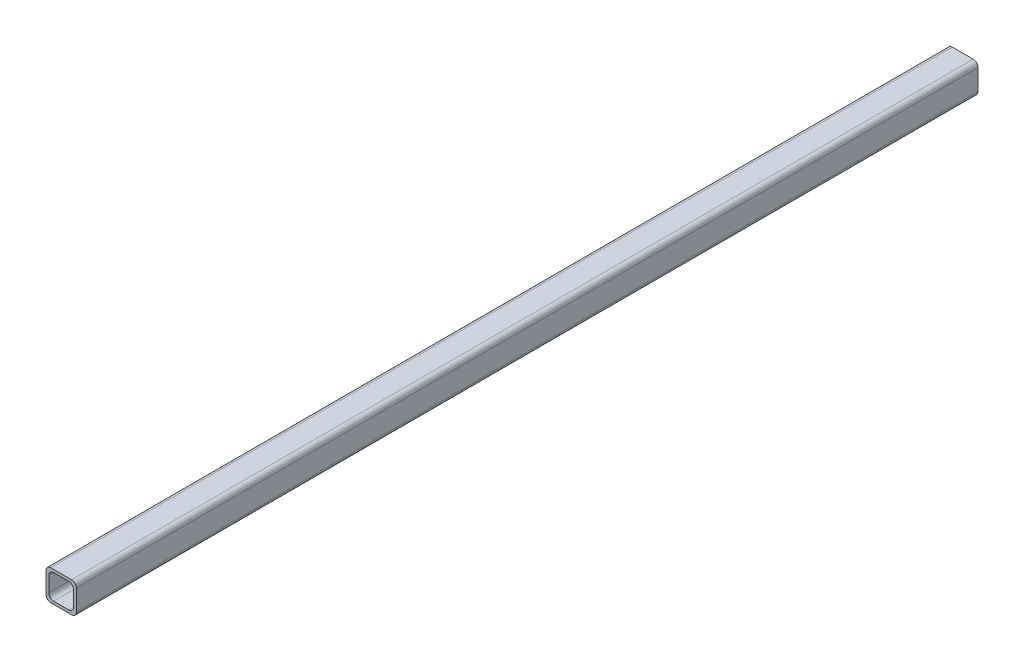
ISO-10303-21;
HEADER;
FILE_DESCRIPTION(('STEP AP214'),'2;1');
FILE_NAME('part.step','',(''),(''),'','','');
FILE_SCHEMA(('AUTOMOTIVE_DESIGN { 1 0 10303 214 1 1 1 1 }'));
ENDSEC;
DATA;
#1=APPLICATION_CONTEXT('core data for automotive mechanical design processes');
#2=APPLICATION_PROTOCOL_DEFINITION('international standard','automotive_design',2000,#1);
#3=PRODUCT_CONTEXT('',#1,'mechanical');
#4=PRODUCT('Part','Part','',(#3));
#5=PRODUCT_RELATED_PRODUCT_CATEGORY('part','',(#4));
#6=PRODUCT_DEFINITION_FORMATION('','',#4);
#7=PRODUCT_DEFINITION_CONTEXT('part definition',#1,'design');
#8=PRODUCT_DEFINITION('design','',#6,#7);
#9=PRODUCT_DEFINITION_SHAPE('','',#8);
#10=(LENGTH_UNIT() NAMED_UNIT(*) SI_UNIT(.MILLI.,.METRE.));
#11=(NAMED_UNIT(*) PLANE_ANGLE_UNIT() SI_UNIT($,.RADIAN.));
#12=(NAMED_UNIT(*) SI_UNIT($,.STERADIAN.) SOLID_ANGLE_UNIT());
#13=UNCERTAINTY_MEASURE_WITH_UNIT(LENGTH_MEASURE(1.E-05),#10,'distance_accuracy_value','');
#14=(GEOMETRIC_REPRESENTATION_CONTEXT(3) GLOBAL_UNCERTAINTY_ASSIGNED_CONTEXT((#13)) GLOBAL_UNIT_ASSIGNED_CONTEXT((#10,
#11,#12)) REPRESENTATION_CONTEXT('',''));
#15=CARTESIAN_POINT('',(0.,0.,0.));
#16=DIRECTION('',(0.,0.,1.));
#17=DIRECTION('',(1.,0.,0.));
#18=AXIS2_PLACEMENT_3D('',#15,#16,#17);
#19=CARTESIAN_POINT('',(-5.49999999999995,5.50000000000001,475.));
#20=DIRECTION('',(0.,0.,1.));
#21=DIRECTION('',(1.,0.,0.));
#22=AXIS2_PLACEMENT_3D('',#19,#20,#21);
#23=PLANE('',#22);
#24=CARTESIAN_POINT('',(-5.49999999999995,5.50000000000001,475.));
#25=DIRECTION('',(0.,0.,1.));
#26=DIRECTION('',(1.,0.,0.));
#27=AXIS2_PLACEMENT_3D('',#24,#25,#26);
#28=CIRCLE('',#27,2.5);
#29=CARTESIAN_POINT('',(-5.49999999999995,8.00000000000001,475.));
#30=VERTEX_POINT('',#29);
#31=CARTESIAN_POINT('',(-7.99999999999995,5.50000000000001,475.));
#32=VERTEX_POINT('',#31);
#33=EDGE_CURVE('E232',#30,#32,#28,.T.);
#34=ORIENTED_EDGE('',*,*,#33,.T.);
#35=DIRECTION('',(0.,-1.,0.));
#36=VECTOR('',#35,1.);
#37=CARTESIAN_POINT('',(-7.99999999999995,5.50000000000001,475.));
#38=LINE('',#37,#36);
#39=CARTESIAN_POINT('',(-7.99999999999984,-5.50000000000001,475.));
#40=VERTEX_POINT('',#39);
#41=EDGE_CURVE('E235',#32,#40,#38,.T.);
#42=ORIENTED_EDGE('',*,*,#41,.T.);
#43=CARTESIAN_POINT('',(-5.49999999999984,-5.50000000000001,475.));
#44=DIRECTION('',(0.,0.,-1.));
#45=DIRECTION('',(-1.,0.,0.));
#46=AXIS2_PLACEMENT_3D('',#43,#44,#45);
#47=CIRCLE('',#46,2.5);
#48=CARTESIAN_POINT('',(-5.49999999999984,-8.00000000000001,475.));
#49=VERTEX_POINT('',#48);
#50=EDGE_CURVE('E238',#49,#40,#47,.T.);
#51=ORIENTED_EDGE('',*,*,#50,.F.);
#52=DIRECTION('',(-1.,0.,0.));
#53=VECTOR('',#52,1.);
#54=CARTESIAN_POINT('',(5.50000000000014,-8.00000000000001,475.));
#55=LINE('',#54,#53);
#56=CARTESIAN_POINT('',(5.50000000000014,-8.00000000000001,475.));
#57=VERTEX_POINT('',#56);
#58=EDGE_CURVE('E241',#57,#49,#55,.T.);
#59=ORIENTED_EDGE('',*,*,#58,.F.);
#60=CARTESIAN_POINT('',(5.50000000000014,-5.50000000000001,475.));
#61=DIRECTION('',(0.,0.,-1.));
#62=DIRECTION('',(-1.,0.,0.));
#63=AXIS2_PLACEMENT_3D('',#60,#61,#62);
#64=CIRCLE('',#63,2.5);
#65=CARTESIAN_POINT('',(8.00000000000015,-5.50000000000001,475.));
#66=VERTEX_POINT('',#65);
#67=EDGE_CURVE('E244',#66,#57,#64,.T.);
#68=ORIENTED_EDGE('',*,*,#67,.F.);
#69=DIRECTION('',(0.,1.,0.));
#70=VECTOR('',#69,1.);
#71=CARTESIAN_POINT('',(8.00000000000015,-5.50000000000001,475.));
#72=LINE('',#71,#70);
#73=CARTESIAN_POINT('',(8.00000000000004,5.50000000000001,475.));
#74=VERTEX_POINT('',#73);
#75=EDGE_CURVE('E247',#66,#74,#72,.T.);
#76=ORIENTED_EDGE('',*,*,#75,.T.);
#77=CARTESIAN_POINT('',(5.50000000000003,5.50000000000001,475.));
#78=DIRECTION('',(0.,0.,1.));
#79=DIRECTION('',(1.,0.,0.));
#80=AXIS2_PLACEMENT_3D('',#77,#78,#79);
#81=CIRCLE('',#80,2.5);
#82=CARTESIAN_POINT('',(5.50000000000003,8.00000000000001,475.));
#83=VERTEX_POINT('',#82);
#84=EDGE_CURVE('E250',#74,#83,#81,.T.);
#85=ORIENTED_EDGE('',*,*,#84,.T.);
#86=DIRECTION('',(1.,0.,0.));
#87=VECTOR('',#86,1.);
#88=CARTESIAN_POINT('',(-5.49999999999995,8.00000000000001,475.));
#89=LINE('',#88,#87);
#90=EDGE_CURVE('E253',#30,#83,#89,.T.);
#91=ORIENTED_EDGE('',*,*,#90,.F.);
#92=EDGE_LOOP('',(#34,#42,#51,#59,#68,#76,#85,#91));
#93=FACE_BOUND('',#92,.T.);
#94=DIRECTION('',(0.,-1.,0.));
#95=VECTOR('',#94,1.);
#96=CARTESIAN_POINT('',(-6.49999999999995,4.,475.));
#97=LINE('',#96,#95);
#98=CARTESIAN_POINT('',(-6.49999999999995,4.,475.));
#99=VERTEX_POINT('',#98);
#100=CARTESIAN_POINT('',(-6.49999999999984,-4.,475.));
#101=VERTEX_POINT('',#100);
#102=EDGE_CURVE('E178',#99,#101,#97,.T.);
#103=ORIENTED_EDGE('',*,*,#102,.F.);
#104=CARTESIAN_POINT('',(-3.99999999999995,4.,475.));
#105=DIRECTION('',(0.,0.,1.));
#106=DIRECTION('',(1.,0.,0.));
#107=AXIS2_PLACEMENT_3D('',#104,#105,#106);
#108=CIRCLE('',#107,2.5);
#109=CARTESIAN_POINT('',(-3.99999999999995,6.50000000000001,475.));
#110=VERTEX_POINT('',#109);
#111=EDGE_CURVE('E142',#110,#99,#108,.T.);
#112=ORIENTED_EDGE('',*,*,#111,.F.);
#113=DIRECTION('',(1.,0.,0.));
#114=VECTOR('',#113,1.);
#115=CARTESIAN_POINT('',(-3.99999999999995,6.50000000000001,475.));
#116=LINE('',#115,#114);
#117=CARTESIAN_POINT('',(4.00000000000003,6.50000000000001,475.));
#118=VERTEX_POINT('',#117);
#119=EDGE_CURVE('E193',#110,#118,#116,.T.);
#120=ORIENTED_EDGE('',*,*,#119,.T.);
#121=CARTESIAN_POINT('',(4.00000000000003,4.,475.));
#122=DIRECTION('',(0.,0.,1.));
#123=DIRECTION('',(1.,0.,0.));
#124=AXIS2_PLACEMENT_3D('',#121,#122,#123);
#125=CIRCLE('',#124,2.5);
#126=CARTESIAN_POINT('',(6.50000000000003,4.,475.));
#127=VERTEX_POINT('',#126);
#128=EDGE_CURVE('E43',#127,#118,#125,.T.);
#129=ORIENTED_EDGE('',*,*,#128,.F.);
#130=DIRECTION('',(0.,1.,0.));
#131=VECTOR('',#130,1.);
#132=CARTESIAN_POINT('',(6.50000000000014,-4.,475.));
#133=LINE('',#132,#131);
#134=CARTESIAN_POINT('',(6.50000000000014,-4.,475.));
#135=VERTEX_POINT('',#134);
#136=EDGE_CURVE('E189',#135,#127,#133,.T.);
#137=ORIENTED_EDGE('',*,*,#136,.F.);
#138=CARTESIAN_POINT('',(4.00000000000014,-4.,475.));
#139=DIRECTION('',(0.,0.,-1.));
#140=DIRECTION('',(-1.,0.,0.));
#141=AXIS2_PLACEMENT_3D('',#138,#139,#140);
#142=CIRCLE('',#141,2.5);
#143=CARTESIAN_POINT('',(4.00000000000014,-6.50000000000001,475.));
#144=VERTEX_POINT('',#143);
#145=EDGE_CURVE('E186',#135,#144,#142,.T.);
#146=ORIENTED_EDGE('',*,*,#145,.T.);
#147=DIRECTION('',(-1.,0.,0.));
#148=VECTOR('',#147,1.);
#149=CARTESIAN_POINT('',(4.00000000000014,-6.50000000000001,475.));
#150=LINE('',#149,#148);
#151=CARTESIAN_POINT('',(-3.99999999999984,-6.50000000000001,475.));
#152=VERTEX_POINT('',#151);
#153=EDGE_CURVE('E183',#144,#152,#150,.T.);
#154=ORIENTED_EDGE('',*,*,#153,.T.);
#155=CARTESIAN_POINT('',(-3.99999999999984,-4.,475.));
#156=DIRECTION('',(0.,0.,1.));
#157=DIRECTION('',(1.,0.,0.));
#158=AXIS2_PLACEMENT_3D('',#155,#156,#157);
#159=CIRCLE('',#158,2.5);
#160=EDGE_CURVE('E180',#101,#152,#159,.T.);
#161=ORIENTED_EDGE('',*,*,#160,.F.);
#162=EDGE_LOOP('',(#103,#112,#120,#129,#137,#146,#154,#161));
#163=FACE_BOUND('',#162,.T.);
#164=ADVANCED_FACE('F28',(#93,#163),#23,.T.);
#165=CARTESIAN_POINT('',(-5.50000000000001,5.50000000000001,0.));
#166=DIRECTION('',(0.,0.,1.));
#167=DIRECTION('',(1.,0.,0.));
#168=AXIS2_PLACEMENT_3D('',#165,#166,#167);
#169=PLANE('',#168);
#170=CARTESIAN_POINT('',(-5.50000000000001,5.50000000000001,0.));
#171=DIRECTION('',(0.,0.,1.));
#172=DIRECTION('',(1.,0.,0.));
#173=AXIS2_PLACEMENT_3D('',#170,#171,#172);
#174=CIRCLE('',#173,2.5);
#175=CARTESIAN_POINT('',(-5.50000000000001,8.00000000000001,0.));
#176=VERTEX_POINT('',#175);
#177=CARTESIAN_POINT('',(-8.00000000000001,5.50000000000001,0.));
#178=VERTEX_POINT('',#177);
#179=EDGE_CURVE('E146',#176,#178,#174,.T.);
#180=ORIENTED_EDGE('',*,*,#179,.F.);
#181=DIRECTION('',(1.,0.,0.));
#182=VECTOR('',#181,1.);
#183=CARTESIAN_POINT('',(-5.50000000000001,8.00000000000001,0.));
#184=LINE('',#183,#182);
#185=CARTESIAN_POINT('',(5.50000000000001,8.00000000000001,0.));
#186=VERTEX_POINT('',#185);
#187=EDGE_CURVE('E229',#176,#186,#184,.T.);
#188=ORIENTED_EDGE('',*,*,#187,.T.);
#189=CARTESIAN_POINT('',(5.49999999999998,5.50000000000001,0.));
#190=DIRECTION('',(0.,0.,1.));
#191=DIRECTION('',(1.,0.,0.));
#192=AXIS2_PLACEMENT_3D('',#189,#190,#191);
#193=CIRCLE('',#192,2.5);
#194=CARTESIAN_POINT('',(7.99999999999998,5.50000000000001,0.));
#195=VERTEX_POINT('',#194);
#196=EDGE_CURVE('E226',#195,#186,#193,.T.);
#197=ORIENTED_EDGE('',*,*,#196,.F.);
#198=DIRECTION('',(0.,1.,0.));
#199=VECTOR('',#198,1.);
#200=CARTESIAN_POINT('',(7.99999999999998,-5.50000000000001,0.));
#201=LINE('',#200,#199);
#202=CARTESIAN_POINT('',(7.99999999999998,-5.50000000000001,0.));
#203=VERTEX_POINT('',#202);
#204=EDGE_CURVE('E223',#203,#195,#201,.T.);
#205=ORIENTED_EDGE('',*,*,#204,.F.);
#206=CARTESIAN_POINT('',(5.49999999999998,-5.50000000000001,0.));
#207=DIRECTION('',(0.,0.,-1.));
#208=DIRECTION('',(-1.,0.,0.));
#209=AXIS2_PLACEMENT_3D('',#206,#207,#208);
#210=CIRCLE('',#209,2.5);
#211=CARTESIAN_POINT('',(5.49999999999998,-8.00000000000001,0.));
#212=VERTEX_POINT('',#211);
#213=EDGE_CURVE('E220',#203,#212,#210,.T.);
#214=ORIENTED_EDGE('',*,*,#213,.T.);
#215=DIRECTION('',(-1.,0.,0.));
#216=VECTOR('',#215,1.);
#217=CARTESIAN_POINT('',(5.49999999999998,-8.00000000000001,0.));
#218=LINE('',#217,#216);
#219=CARTESIAN_POINT('',(-5.50000000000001,-8.00000000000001,0.));
#220=VERTEX_POINT('',#219);
#221=EDGE_CURVE('E217',#212,#220,#218,.T.);
#222=ORIENTED_EDGE('',*,*,#221,.T.);
#223=CARTESIAN_POINT('',(-5.50000000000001,-5.50000000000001,0.));
#224=DIRECTION('',(0.,0.,-1.));
#225=DIRECTION('',(-1.,0.,0.));
#226=AXIS2_PLACEMENT_3D('',#223,#224,#225);
#227=CIRCLE('',#226,2.5);
#228=CARTESIAN_POINT('',(-8.00000000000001,-5.50000000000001,0.));
#229=VERTEX_POINT('',#228);
#230=EDGE_CURVE('E214',#220,#229,#227,.T.);
#231=ORIENTED_EDGE('',*,*,#230,.T.);
#232=DIRECTION('',(0.,-1.,0.));
#233=VECTOR('',#232,1.);
#234=CARTESIAN_POINT('',(-8.00000000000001,5.50000000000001,0.));
#235=LINE('',#234,#233);
#236=EDGE_CURVE('E211',#178,#229,#235,.T.);
#237=ORIENTED_EDGE('',*,*,#236,.F.);
#238=EDGE_LOOP('',(#180,#188,#197,#205,#214,#222,#231,#237));
#239=FACE_BOUND('',#238,.T.);
#240=CARTESIAN_POINT('',(-4.,4.,0.));
#241=DIRECTION('',(0.,0.,1.));
#242=DIRECTION('',(1.,0.,0.));
#243=AXIS2_PLACEMENT_3D('',#240,#241,#242);
#244=CIRCLE('',#243,2.5);
#245=CARTESIAN_POINT('',(-4.,6.50000000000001,0.));
#246=VERTEX_POINT('',#245);
#247=CARTESIAN_POINT('',(-6.50000000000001,4.,0.));
#248=VERTEX_POINT('',#247);
#249=EDGE_CURVE('E51',#246,#248,#244,.T.);
#250=ORIENTED_EDGE('',*,*,#249,.T.);
#251=DIRECTION('',(0.,-1.,0.));
#252=VECTOR('',#251,1.);
#253=CARTESIAN_POINT('',(-6.50000000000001,4.,0.));
#254=LINE('',#253,#252);
#255=CARTESIAN_POINT('',(-6.50000000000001,-4.,0.));
#256=VERTEX_POINT('',#255);
#257=EDGE_CURVE('E150',#248,#256,#254,.T.);
#258=ORIENTED_EDGE('',*,*,#257,.T.);
#259=CARTESIAN_POINT('',(-4.,-4.,0.));
#260=DIRECTION('',(0.,0.,1.));
#261=DIRECTION('',(1.,0.,0.));
#262=AXIS2_PLACEMENT_3D('',#259,#260,#261);
#263=CIRCLE('',#262,2.5);
#264=CARTESIAN_POINT('',(-4.,-6.50000000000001,0.));
#265=VERTEX_POINT('',#264);
#266=EDGE_CURVE('E155',#256,#265,#263,.T.);
#267=ORIENTED_EDGE('',*,*,#266,.T.);
#268=DIRECTION('',(-1.,0.,0.));
#269=VECTOR('',#268,1.);
#270=CARTESIAN_POINT('',(4.,-6.50000000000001,0.));
#271=LINE('',#270,#269);
#272=CARTESIAN_POINT('',(4.,-6.50000000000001,0.));
#273=VERTEX_POINT('',#272);
#274=EDGE_CURVE('E165',#273,#265,#271,.T.);
#275=ORIENTED_EDGE('',*,*,#274,.F.);
#276=CARTESIAN_POINT('',(4.,-4.,0.));
#277=DIRECTION('',(0.,0.,-1.));
#278=DIRECTION('',(-1.,0.,0.));
#279=AXIS2_PLACEMENT_3D('',#276,#277,#278);
#280=CIRCLE('',#279,2.5);
#281=CARTESIAN_POINT('',(6.49999999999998,-4.,0.));
#282=VERTEX_POINT('',#281);
#283=EDGE_CURVE('E168',#282,#273,#280,.T.);
#284=ORIENTED_EDGE('',*,*,#283,.F.);
#285=DIRECTION('',(0.,1.,0.));
#286=VECTOR('',#285,1.);
#287=CARTESIAN_POINT('',(6.49999999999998,-4.,0.));
#288=LINE('',#287,#286);
#289=CARTESIAN_POINT('',(6.50000000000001,4.,0.));
#290=VERTEX_POINT('',#289);
#291=EDGE_CURVE('E171',#282,#290,#288,.T.);
#292=ORIENTED_EDGE('',*,*,#291,.T.);
#293=CARTESIAN_POINT('',(4.,4.,0.));
#294=DIRECTION('',(0.,0.,1.));
#295=DIRECTION('',(1.,0.,0.));
#296=AXIS2_PLACEMENT_3D('',#293,#294,#295);
#297=CIRCLE('',#296,2.5);
#298=CARTESIAN_POINT('',(4.,6.50000000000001,0.));
#299=VERTEX_POINT('',#298);
#300=EDGE_CURVE('E174',#290,#299,#297,.T.);
#301=ORIENTED_EDGE('',*,*,#300,.T.);
#302=DIRECTION('',(1.,0.,0.));
#303=VECTOR('',#302,1.);
#304=CARTESIAN_POINT('',(-4.,6.50000000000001,0.));
#305=LINE('',#304,#303);
#306=EDGE_CURVE('E161',#246,#299,#305,.T.);
#307=ORIENTED_EDGE('',*,*,#306,.F.);
#308=EDGE_LOOP('',(#250,#258,#267,#275,#284,#292,#301,#307));
#309=FACE_BOUND('',#308,.T.);
#310=ADVANCED_FACE('F158',(#239,#309),#169,.F.);
#311=CARTESIAN_POINT('',(-5.49999999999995,5.50000000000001,475.));
#312=DIRECTION('',(0.,0.,-1.));
#313=DIRECTION('',(-1.,0.,0.));
#314=AXIS2_PLACEMENT_3D('',#311,#312,#313);
#315=CYLINDRICAL_SURFACE('',#314,2.5);
#316=DIRECTION('',(0.,0.,-1.));
#317=VECTOR('',#316,1.);
#318=CARTESIAN_POINT('',(-7.99999999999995,5.50000000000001,475.));
#319=LINE('',#318,#317);
#320=EDGE_CURVE('E11',#32,#178,#319,.T.);
#321=ORIENTED_EDGE('',*,*,#320,.F.);
#322=ORIENTED_EDGE('',*,*,#33,.F.);
#323=DIRECTION('',(0.,0.,-1.));
#324=VECTOR('',#323,1.);
#325=CARTESIAN_POINT('',(-5.49999999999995,8.00000000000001,475.));
#326=LINE('',#325,#324);
#327=EDGE_CURVE('E256',#30,#176,#326,.T.);
#328=ORIENTED_EDGE('',*,*,#327,.T.);
#329=ORIENTED_EDGE('',*,*,#179,.T.);
#330=EDGE_LOOP('',(#321,#322,#328,#329));
#331=FACE_BOUND('',#330,.T.);
#332=ADVANCED_FACE('F288',(#331),#315,.T.);
#333=CARTESIAN_POINT('',(-7.99999999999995,5.50000000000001,475.));
#334=DIRECTION('',(1.,0.,0.));
#335=DIRECTION('',(0.,0.,-1.));
#336=AXIS2_PLACEMENT_3D('',#333,#334,#335);
#337=PLANE('',#336);
#338=DIRECTION('',(0.,0.,-1.));
#339=VECTOR('',#338,1.);
#340=CARTESIAN_POINT('',(-7.99999999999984,-5.50000000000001,475.));
#341=LINE('',#340,#339);
#342=EDGE_CURVE('E36',#40,#229,#341,.T.);
#343=ORIENTED_EDGE('',*,*,#342,.F.);
#344=ORIENTED_EDGE('',*,*,#41,.F.);
#345=ORIENTED_EDGE('',*,*,#320,.T.);
#346=ORIENTED_EDGE('',*,*,#236,.T.);
#347=EDGE_LOOP('',(#343,#344,#345,#346));
#348=FACE_BOUND('',#347,.T.);
#349=ADVANCED_FACE('F30',(#348),#337,.F.);
#350=CARTESIAN_POINT('',(-5.49999999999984,-5.50000000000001,475.));
#351=DIRECTION('',(0.,0.,-1.));
#352=DIRECTION('',(-1.,0.,0.));
#353=AXIS2_PLACEMENT_3D('',#350,#351,#352);
#354=CYLINDRICAL_SURFACE('',#353,2.5);
#355=DIRECTION('',(0.,0.,-1.));
#356=VECTOR('',#355,1.);
#357=CARTESIAN_POINT('',(-5.49999999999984,-8.00000000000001,475.));
#358=LINE('',#357,#356);
#359=EDGE_CURVE('E266',#49,#220,#358,.T.);
#360=ORIENTED_EDGE('',*,*,#359,.F.);
#361=ORIENTED_EDGE('',*,*,#50,.T.);
#362=ORIENTED_EDGE('',*,*,#342,.T.);
#363=ORIENTED_EDGE('',*,*,#230,.F.);
#364=EDGE_LOOP('',(#360,#361,#362,#363));
#365=FACE_BOUND('',#364,.T.);
#366=ADVANCED_FACE('F269',(#365),#354,.T.);
#367=CARTESIAN_POINT('',(5.50000000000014,-8.00000000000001,475.));
#368=DIRECTION('',(0.,-1.,0.));
#369=DIRECTION('',(0.,0.,-1.));
#370=AXIS2_PLACEMENT_3D('',#367,#368,#369);
#371=PLANE('',#370);
#372=DIRECTION('',(0.,0.,-1.));
#373=VECTOR('',#372,1.);
#374=CARTESIAN_POINT('',(5.50000000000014,-8.00000000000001,475.));
#375=LINE('',#374,#373);
#376=EDGE_CURVE('E264',#57,#212,#375,.T.);
#377=ORIENTED_EDGE('',*,*,#376,.F.);
#378=ORIENTED_EDGE('',*,*,#58,.T.);
#379=ORIENTED_EDGE('',*,*,#359,.T.);
#380=ORIENTED_EDGE('',*,*,#221,.F.);
#381=EDGE_LOOP('',(#377,#378,#379,#380));
#382=FACE_BOUND('',#381,.T.);
#383=ADVANCED_FACE('F280',(#382),#371,.T.);
#384=CARTESIAN_POINT('',(5.50000000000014,-5.50000000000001,475.));
#385=DIRECTION('',(0.,0.,-1.));
#386=DIRECTION('',(-1.,0.,0.));
#387=AXIS2_PLACEMENT_3D('',#384,#385,#386);
#388=CYLINDRICAL_SURFACE('',#387,2.5);
#389=DIRECTION('',(0.,0.,-1.));
#390=VECTOR('',#389,1.);
#391=CARTESIAN_POINT('',(8.00000000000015,-5.50000000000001,475.));
#392=LINE('',#391,#390);
#393=EDGE_CURVE('E262',#66,#203,#392,.T.);
#394=ORIENTED_EDGE('',*,*,#393,.F.);
#395=ORIENTED_EDGE('',*,*,#67,.T.);
#396=ORIENTED_EDGE('',*,*,#376,.T.);
#397=ORIENTED_EDGE('',*,*,#213,.F.);
#398=EDGE_LOOP('',(#394,#395,#396,#397));
#399=FACE_BOUND('',#398,.T.);
#400=ADVANCED_FACE('F300',(#399),#388,.T.);
#401=CARTESIAN_POINT('',(8.00000000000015,-5.50000000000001,475.));
#402=DIRECTION('',(-1.,0.,0.));
#403=DIRECTION('',(0.,0.,1.));
#404=AXIS2_PLACEMENT_3D('',#401,#402,#403);
#405=PLANE('',#404);
#406=DIRECTION('',(0.,0.,-1.));
#407=VECTOR('',#406,1.);
#408=CARTESIAN_POINT('',(8.00000000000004,5.50000000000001,475.));
#409=LINE('',#408,#407);
#410=EDGE_CURVE('E260',#74,#195,#409,.T.);
#411=ORIENTED_EDGE('',*,*,#410,.F.);
#412=ORIENTED_EDGE('',*,*,#75,.F.);
#413=ORIENTED_EDGE('',*,*,#393,.T.);
#414=ORIENTED_EDGE('',*,*,#204,.T.);
#415=EDGE_LOOP('',(#411,#412,#413,#414));
#416=FACE_BOUND('',#415,.T.);
#417=ADVANCED_FACE('F297',(#416),#405,.F.);
#418=CARTESIAN_POINT('',(5.50000000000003,5.50000000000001,475.));
#419=DIRECTION('',(0.,0.,-1.));
#420=DIRECTION('',(-1.,0.,0.));
#421=AXIS2_PLACEMENT_3D('',#418,#419,#420);
#422=CYLINDRICAL_SURFACE('',#421,2.5);
#423=DIRECTION('',(0.,0.,-1.));
#424=VECTOR('',#423,1.);
#425=CARTESIAN_POINT('',(5.50000000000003,8.00000000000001,475.));
#426=LINE('',#425,#424);
#427=EDGE_CURVE('E258',#83,#186,#426,.T.);
#428=ORIENTED_EDGE('',*,*,#427,.F.);
#429=ORIENTED_EDGE('',*,*,#84,.F.);
#430=ORIENTED_EDGE('',*,*,#410,.T.);
#431=ORIENTED_EDGE('',*,*,#196,.T.);
#432=EDGE_LOOP('',(#428,#429,#430,#431));
#433=FACE_BOUND('',#432,.T.);
#434=ADVANCED_FACE('F295',(#433),#422,.T.);
#435=CARTESIAN_POINT('',(-5.49999999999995,8.00000000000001,475.));
#436=DIRECTION('',(0.,1.,0.));
#437=DIRECTION('',(0.,0.,1.));
#438=AXIS2_PLACEMENT_3D('',#435,#436,#437);
#439=PLANE('',#438);
#440=ORIENTED_EDGE('',*,*,#90,.T.);
#441=ORIENTED_EDGE('',*,*,#427,.T.);
#442=ORIENTED_EDGE('',*,*,#187,.F.);
#443=ORIENTED_EDGE('',*,*,#327,.F.);
#444=EDGE_LOOP('',(#440,#441,#442,#443));
#445=FACE_BOUND('',#444,.T.);
#446=ADVANCED_FACE('F292',(#445),#439,.T.);
#447=CARTESIAN_POINT('',(-3.99999999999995,4.,475.));
#448=DIRECTION('',(0.,0.,-1.));
#449=DIRECTION('',(-1.,0.,0.));
#450=AXIS2_PLACEMENT_3D('',#447,#448,#449);
#451=CYLINDRICAL_SURFACE('',#450,2.5);
#452=DIRECTION('',(0.,0.,-1.));
#453=VECTOR('',#452,1.);
#454=CARTESIAN_POINT('',(-6.49999999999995,4.,475.));
#455=LINE('',#454,#453);
#456=EDGE_CURVE('E138',#99,#248,#455,.T.);
#457=ORIENTED_EDGE('',*,*,#456,.T.);
#458=ORIENTED_EDGE('',*,*,#249,.F.);
#459=DIRECTION('',(0.,0.,-1.));
#460=VECTOR('',#459,1.);
#461=CARTESIAN_POINT('',(-3.99999999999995,6.50000000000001,475.));
#462=LINE('',#461,#460);
#463=EDGE_CURVE('E196',#110,#246,#462,.T.);
#464=ORIENTED_EDGE('',*,*,#463,.F.);
#465=ORIENTED_EDGE('',*,*,#111,.T.);
#466=EDGE_LOOP('',(#457,#458,#464,#465));
#467=FACE_BOUND('',#466,.T.);
#468=ADVANCED_FACE('F140',(#467),#451,.F.);
#469=CARTESIAN_POINT('',(-6.49999999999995,4.,475.));
#470=DIRECTION('',(1.,0.,0.));
#471=DIRECTION('',(0.,0.,-1.));
#472=AXIS2_PLACEMENT_3D('',#469,#470,#471);
#473=PLANE('',#472);
#474=DIRECTION('',(0.,0.,-1.));
#475=VECTOR('',#474,1.);
#476=CARTESIAN_POINT('',(-6.49999999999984,-4.,475.));
#477=LINE('',#476,#475);
#478=EDGE_CURVE('E147',#101,#256,#477,.T.);
#479=ORIENTED_EDGE('',*,*,#478,.T.);
#480=ORIENTED_EDGE('',*,*,#257,.F.);
#481=ORIENTED_EDGE('',*,*,#456,.F.);
#482=ORIENTED_EDGE('',*,*,#102,.T.);
#483=EDGE_LOOP('',(#479,#480,#481,#482));
#484=FACE_BOUND('',#483,.T.);
#485=ADVANCED_FACE('F151',(#484),#473,.T.);
#486=CARTESIAN_POINT('',(-3.99999999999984,-4.,475.));
#487=DIRECTION('',(0.,0.,-1.));
#488=DIRECTION('',(-1.,0.,0.));
#489=AXIS2_PLACEMENT_3D('',#486,#487,#488);
#490=CYLINDRICAL_SURFACE('',#489,2.5);
#491=DIRECTION('',(0.,0.,-1.));
#492=VECTOR('',#491,1.);
#493=CARTESIAN_POINT('',(-3.99999999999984,-6.50000000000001,475.));
#494=LINE('',#493,#492);
#495=EDGE_CURVE('E206',#152,#265,#494,.T.);
#496=ORIENTED_EDGE('',*,*,#495,.T.);
#497=ORIENTED_EDGE('',*,*,#266,.F.);
#498=ORIENTED_EDGE('',*,*,#478,.F.);
#499=ORIENTED_EDGE('',*,*,#160,.T.);
#500=EDGE_LOOP('',(#496,#497,#498,#499));
#501=FACE_BOUND('',#500,.T.);
#502=ADVANCED_FACE('F342',(#501),#490,.F.);
#503=CARTESIAN_POINT('',(4.00000000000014,-6.50000000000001,475.));
#504=DIRECTION('',(0.,-1.,0.));
#505=DIRECTION('',(0.,0.,-1.));
#506=AXIS2_PLACEMENT_3D('',#503,#504,#505);
#507=PLANE('',#506);
#508=DIRECTION('',(0.,0.,-1.));
#509=VECTOR('',#508,1.);
#510=CARTESIAN_POINT('',(4.00000000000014,-6.50000000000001,475.));
#511=LINE('',#510,#509);
#512=EDGE_CURVE('E204',#144,#273,#511,.T.);
#513=ORIENTED_EDGE('',*,*,#512,.T.);
#514=ORIENTED_EDGE('',*,*,#274,.T.);
#515=ORIENTED_EDGE('',*,*,#495,.F.);
#516=ORIENTED_EDGE('',*,*,#153,.F.);
#517=EDGE_LOOP('',(#513,#514,#515,#516));
#518=FACE_BOUND('',#517,.T.);
#519=ADVANCED_FACE('F348',(#518),#507,.F.);
#520=CARTESIAN_POINT('',(4.00000000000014,-4.,475.));
#521=DIRECTION('',(0.,0.,-1.));
#522=DIRECTION('',(-1.,0.,0.));
#523=AXIS2_PLACEMENT_3D('',#520,#521,#522);
#524=CYLINDRICAL_SURFACE('',#523,2.5);
#525=DIRECTION('',(0.,0.,-1.));
#526=VECTOR('',#525,1.);
#527=CARTESIAN_POINT('',(6.50000000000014,-4.,475.));
#528=LINE('',#527,#526);
#529=EDGE_CURVE('E202',#135,#282,#528,.T.);
#530=ORIENTED_EDGE('',*,*,#529,.T.);
#531=ORIENTED_EDGE('',*,*,#283,.T.);
#532=ORIENTED_EDGE('',*,*,#512,.F.);
#533=ORIENTED_EDGE('',*,*,#145,.F.);
#534=EDGE_LOOP('',(#530,#531,#532,#533));
#535=FACE_BOUND('',#534,.T.);
#536=ADVANCED_FACE('F356',(#535),#524,.F.);
#537=CARTESIAN_POINT('',(6.50000000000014,-4.,475.));
#538=DIRECTION('',(-1.,0.,0.));
#539=DIRECTION('',(0.,0.,1.));
#540=AXIS2_PLACEMENT_3D('',#537,#538,#539);
#541=PLANE('',#540);
#542=DIRECTION('',(0.,0.,-1.));
#543=VECTOR('',#542,1.);
#544=CARTESIAN_POINT('',(6.50000000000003,4.,475.));
#545=LINE('',#544,#543);
#546=EDGE_CURVE('E200',#127,#290,#545,.T.);
#547=ORIENTED_EDGE('',*,*,#546,.T.);
#548=ORIENTED_EDGE('',*,*,#291,.F.);
#549=ORIENTED_EDGE('',*,*,#529,.F.);
#550=ORIENTED_EDGE('',*,*,#136,.T.);
#551=EDGE_LOOP('',(#547,#548,#549,#550));
#552=FACE_BOUND('',#551,.T.);
#553=ADVANCED_FACE('F364',(#552),#541,.T.);
#554=CARTESIAN_POINT('',(4.00000000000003,4.,475.));
#555=DIRECTION('',(0.,0.,-1.));
#556=DIRECTION('',(-1.,0.,0.));
#557=AXIS2_PLACEMENT_3D('',#554,#555,#556);
#558=CYLINDRICAL_SURFACE('',#557,2.5);
#559=DIRECTION('',(0.,0.,-1.));
#560=VECTOR('',#559,1.);
#561=CARTESIAN_POINT('',(4.00000000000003,6.50000000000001,475.));
#562=LINE('',#561,#560);
#563=EDGE_CURVE('E198',#118,#299,#562,.T.);
#564=ORIENTED_EDGE('',*,*,#563,.T.);
#565=ORIENTED_EDGE('',*,*,#300,.F.);
#566=ORIENTED_EDGE('',*,*,#546,.F.);
#567=ORIENTED_EDGE('',*,*,#128,.T.);
#568=EDGE_LOOP('',(#564,#565,#566,#567));
#569=FACE_BOUND('',#568,.T.);
#570=ADVANCED_FACE('F372',(#569),#558,.F.);
#571=CARTESIAN_POINT('',(-3.99999999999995,6.50000000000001,475.));
#572=DIRECTION('',(0.,1.,0.));
#573=DIRECTION('',(0.,0.,1.));
#574=AXIS2_PLACEMENT_3D('',#571,#572,#573);
#575=PLANE('',#574);
#576=ORIENTED_EDGE('',*,*,#119,.F.);
#577=ORIENTED_EDGE('',*,*,#463,.T.);
#578=ORIENTED_EDGE('',*,*,#306,.T.);
#579=ORIENTED_EDGE('',*,*,#563,.F.);
#580=EDGE_LOOP('',(#576,#577,#578,#579));
#581=FACE_BOUND('',#580,.T.);
#582=ADVANCED_FACE('F380',(#581),#575,.F.);
#583=CLOSED_SHELL('',(#164,#310,#332,#349,#366,#383,#400,#417,#434,#446,#468,#485,#502,#519,
#536,#553,#570,#582));
#584=MANIFOLD_SOLID_BREP('B2',#583);
#585=ADVANCED_BREP_SHAPE_REPRESENTATION('',(#18,#584),#14);
#586=SHAPE_DEFINITION_REPRESENTATION(#9,#585);
ENDSEC;
END-ISO-10303-21;
